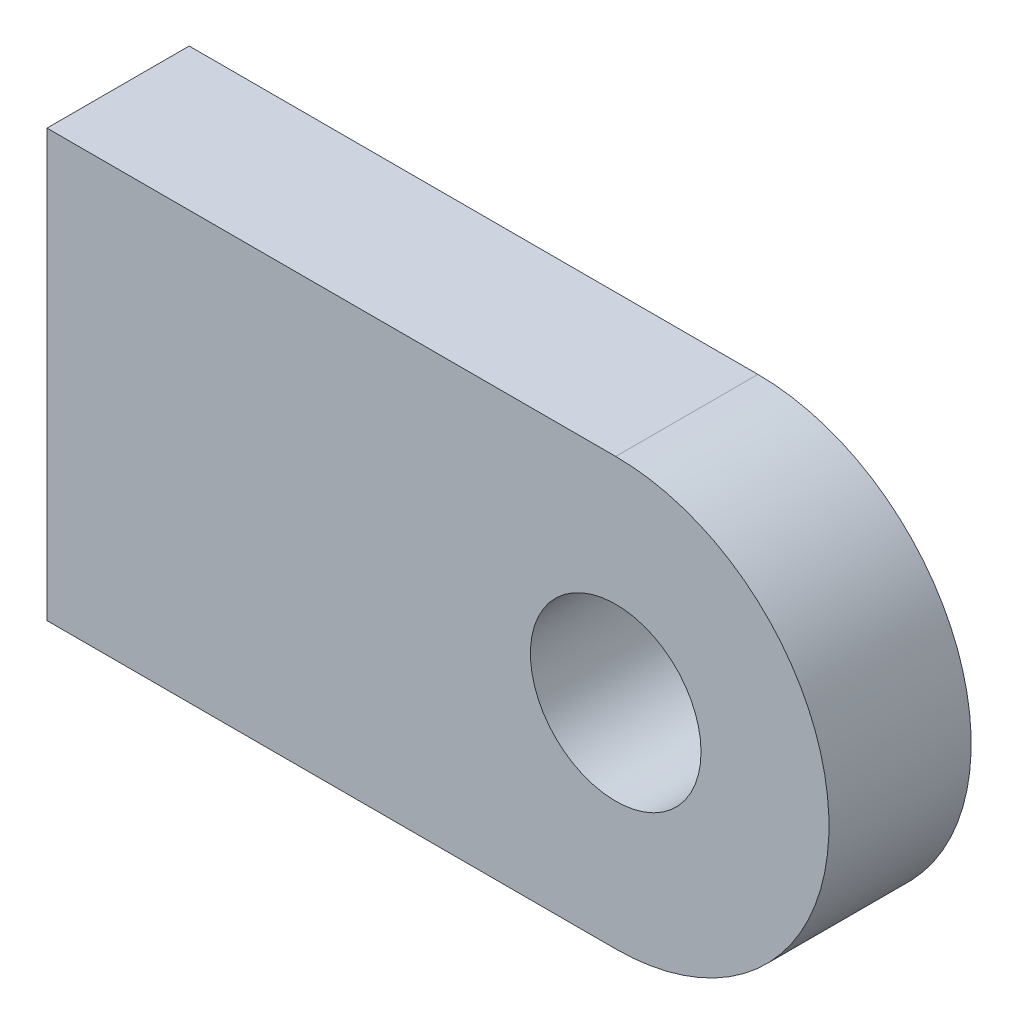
from build123d import *

# Parameters (mm, degrees)
EXTRUSION1_DEPTH        = 10
ESQUISSE2_R             = 6
ENL_V_MAT_EXTRU_1_DEPTH = 10


with BuildPart() as part:
    # Esquisse1 → Extrusion1 (new body)
    with BuildSketch(Plane.XY):
        with BuildLine():
            Line((0, 0), (40, 0))
            ThreePointArc((40, 0), (55, -15), (40, -30))
            Line((40, -30), (0, -30))
            Line((0, -30), (0, 0))
        make_face()
    extrude(amount=EXTRUSION1_DEPTH)

    # Esquisse2 → Enl_v. mat.-Extru.1 (cut)
    with BuildSketch(Plane.XY.offset(10)):
        with Locations((40, -15)):
            Circle(ESQUISSE2_R)
    extrude(amount=-ENL_V_MAT_EXTRU_1_DEPTH, mode=Mode.SUBTRACT)


solid = part.part
